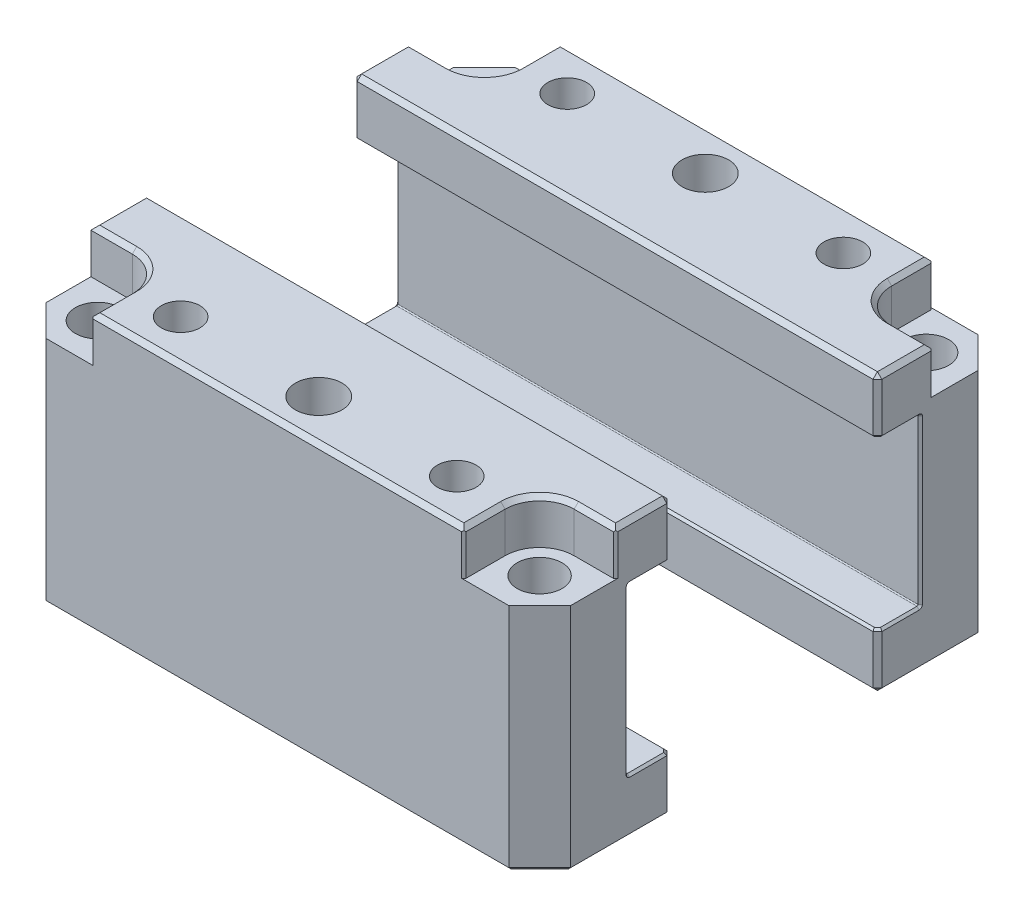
from build123d import *

# Parameters (mm, degrees)
SKETCH1_W                                        = 30.2387
SKETCH1_H                                        = 63.5
BOSS_EXTRUDE1_DEPTH                              = 60.325
CBORE_FOR_3_8_SOCKET_HEAD_CAP_SCREW3_D           = 10.31748
CBORE_FOR_3_8_SOCKET_HEAD_CAP_SCREW3_CBORE_D     = 15.875
CBORE_FOR_3_8_SOCKET_HEAD_CAP_SCREW3_CBORE_DEPTH = 10.287
F_1_2_13_TAPPED_HOLE1_D                          = 10.71626
F_1_2_13_TAPPED_HOLE1_DEPTH                      = 35.179
F_1_2_13_TAPPED_HOLE1_TIP                        = 3.219489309
CHAMFER1_SIZE                                    = 7.112
CUT_EXTRUDE3_DEPTH                               = 10.287
SKETCH9_W                                        = 120.65
SKETCH9_H                                        = 37.9984
CUT_EXTRUDE4_DEPTH                               = 9.8425
F_1_2_13_TAPPED_HOLE2_D                          = 10.71626
F_1_2_13_TAPPED_HOLE2_DEPTH                      = 35.179
F_1_2_13_TAPPED_HOLE2_TIP                        = 3.219489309
FILLET1_R                                        = 0.254
CHAMFER2_SIZE                                    = 1.016
CHAMFER3_SIZE                                    = 0.508
CHAMFER4_SIZE                                    = 0.508


with BuildPart() as part:
    # Sketch1 → Boss-Extrude1 (new, symmetric)
    with BuildSketch(Plane(origin=(0, 0, 0), x_dir=(0, 0, -1), z_dir=(1, 0, 0))):
        with Locations((-38.83025, 31.75)):
            Rectangle(SKETCH1_W, SKETCH1_H)
    extrude(amount=BOSS_EXTRUDE1_DEPTH, both=True)

    # CBORE for 3_8 Socket Head Cap Screw3 (through all)
    with Locations(Plane(origin=(0, 63.5, 0), x_dir=(1, 0, 0), z_dir=(0, 1, 0))):
        with Locations((-50.8, -44.45), (50.8, -44.45)):
            CounterBoreHole(CBORE_FOR_3_8_SOCKET_HEAD_CAP_SCREW3_D / 2, CBORE_FOR_3_8_SOCKET_HEAD_CAP_SCREW3_CBORE_D / 2, CBORE_FOR_3_8_SOCKET_HEAD_CAP_SCREW3_CBORE_DEPTH)

    # 1_2-13 Tapped Hole1
    with Locations(Plane(origin=(0, 63.5, 0), x_dir=(1, 0, 0), z_dir=(0, 1, 0))):
        with Locations((0, -44.45)):
            Hole(F_1_2_13_TAPPED_HOLE1_D / 2, depth=F_1_2_13_TAPPED_HOLE1_DEPTH)
            with Locations((0, 0, -(F_1_2_13_TAPPED_HOLE1_DEPTH + F_1_2_13_TAPPED_HOLE1_TIP / 2))):  # 118° drill point
                Cone(0, F_1_2_13_TAPPED_HOLE1_D / 2, F_1_2_13_TAPPED_HOLE1_TIP, mode=Mode.SUBTRACT)

    # Chamfer1
    chamfer1_edges = [part.edges().sort_by_distance(p)[0] for p in [
        (60.325, 31.75, 53.9496),
        (-60.325, 31.75, 53.9496),
    ]]
    chamfer(chamfer1_edges, length=CHAMFER1_SIZE)

    # Sketch16 → Cut-Revolve1 (revolve, cut)
    with BuildSketch(Plane.XY.offset(44.45)):
        Polygon((-36.195, 63.5), (-36.195, 22.796773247), (-36.5125, 22.606), (-36.5125, 0), (-31.75, 0), (-31.75, 63.5), align=None)
    cut_revolve1 = revolve(axis=Axis((-31.75, 70.137071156, 44.45), (0, -1, 0)), mode=Mode.SUBTRACT)

    # Mirror1: Cut-Revolve1 across plane
    add(cut_revolve1.mirror(Plane(origin=(0, 0, 0), x_dir=(0, 0, 1), z_dir=(1, 0, 0))), mode=Mode.SUBTRACT)

    # Sketch8 → Cut-Extrude3 (cut)
    with BuildSketch(Plane(origin=(0, 63.5, 0), x_dir=(1, 0, 0), z_dir=(0, 1, 0))):
        with BuildLine():
            Line((-50.8, -36.5125), (-60.325, -36.5125))
            Line((-60.325, -36.5125), (-60.325, -53.9496))
            Line((-60.325, -53.9496), (-42.8625, -53.9496))
            Line((-42.8625, -53.9496), (-42.8625, -44.45))
            ThreePointArc((-42.8625, -44.45), (-45.187339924, -38.837339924), (-50.8, -36.5125))
        make_face()
        with BuildLine():
            Line((60.325, -53.9496), (60.325, -36.5125))
            Line((60.325, -36.5125), (50.8, -36.5125))
            ThreePointArc((50.8, -36.5125), (45.187339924, -38.837339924), (42.8625, -44.45))
            Line((42.8625, -44.45), (42.8625, -53.9496))
            Line((42.8625, -53.9496), (60.325, -53.9496))
        make_face()
    extrude(amount=-CUT_EXTRUDE3_DEPTH, mode=Mode.SUBTRACT)

    # Sketch9 → Cut-Extrude4 (cut)
    with BuildSketch(Plane(origin=(0, 0, 23.7109), x_dir=(-1, 0, 0), z_dir=(0, 0, -1))):
        with Locations((0, 31.75)):
            Rectangle(SKETCH9_W, SKETCH9_H)
    extrude(amount=-CUT_EXTRUDE4_DEPTH, mode=Mode.SUBTRACT)

    # 1_2-13 Tapped Hole2
    with Locations(Plane(origin=(0, 0, 0), x_dir=(-1, 0, 0), z_dir=(0, -1, 0))):
        with Locations((50.8, -44.45), (-50.8, -44.45)):
            Hole(F_1_2_13_TAPPED_HOLE2_D / 2, depth=F_1_2_13_TAPPED_HOLE2_DEPTH)
            with Locations((0, 0, -(F_1_2_13_TAPPED_HOLE2_DEPTH + F_1_2_13_TAPPED_HOLE2_TIP / 2))):  # 118° drill point
                Cone(0, F_1_2_13_TAPPED_HOLE2_D / 2, F_1_2_13_TAPPED_HOLE2_TIP, mode=Mode.SUBTRACT)

    # Fillet1
    fillet1_edges = [part.edges().sort_by_distance(p)[0] for p in [
        (0, 50.7492, 33.5534),
        (0, 12.7508, 33.5534),
    ]]
    fillet(fillet1_edges, radius=FILLET1_R)

    # Chamfer2
    chamfer2_edges = [part.edges().sort_by_distance(p)[0] for p in [
        (60.325, 63.5, 30.1117),
        (-60.325, 57.1246, 23.7109),
        (60.325, 57.1246, 23.7109),
        (45.187339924, 63.5, 38.837339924),
        (-45.187339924, 63.5, 38.837339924),
        (60.325, 0, 35.27425),
        (-60.325, 0, 35.27425),
        (0, 0, 53.9496),
        (-56.769, 0, 50.3936),
        (56.769, 0, 50.3936),
        (-60.325, 63.5, 30.1117),
        (-60.325, 6.3754, 23.7109),
        (-55.5625, 63.5, 36.5125),
        (-42.8625, 63.5, 49.1998),
        (60.325, 6.3754, 23.7109),
        (0, 63.5, 23.7109),
        (0, 0, 23.7109),
        (0, 63.5, 53.9496),
        (55.5625, 63.5, 36.5125),
        (42.8625, 63.5, 49.1998),
    ]]
    chamfer(chamfer2_edges, length=CHAMFER2_SIZE)

    # Chamfer3
    chamfer3_edges = [part.edges().sort_by_distance(p)[0] for p in [
        (-60.325, 31.75, 33.5534),
        (60.325, 31.75, 33.5534),
        (60.325, 12.7508, 29.01315),
        (-60.325, 12.7508, 29.01315),
        (-60.325, 50.7492, 29.01315),
        (60.325, 50.7492, 29.01315),
        (-60.325, 12.825194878, 33.479005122),
        (60.325, 12.825194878, 33.479005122),
        (60.325, 50.674805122, 33.479005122),
        (-60.325, 50.674805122, 33.479005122),
        (0, 12.7508, 23.7109),
        (-59.817, 12.7508, 24.2189),
        (59.817, 12.7508, 24.2189),
        (0, 50.7492, 23.7109),
        (59.817, 50.7492, 24.2189),
        (-59.817, 50.7492, 24.2189),
        (-42.8625, 57.8485, 53.9496),
        (42.8625, 57.8485, 53.9496),
        (60.325, 57.8485, 36.5125),
    ]]
    chamfer(chamfer3_edges, length=CHAMFER3_SIZE)

    # Chamfer4
    chamfer4_edges = [part.edges().sort_by_distance(p)[0] for p in [
        (-26.9875, 0, 44.45),
        (26.9875, 0, 44.45),
    ]]
    chamfer(chamfer4_edges, length=CHAMFER4_SIZE)


with BuildPart() as body_2:
    # Mirror3: mirrored copy
    add(part.part.mirror(Plane.XY))


solid = Compound([part.part, body_2.part])
